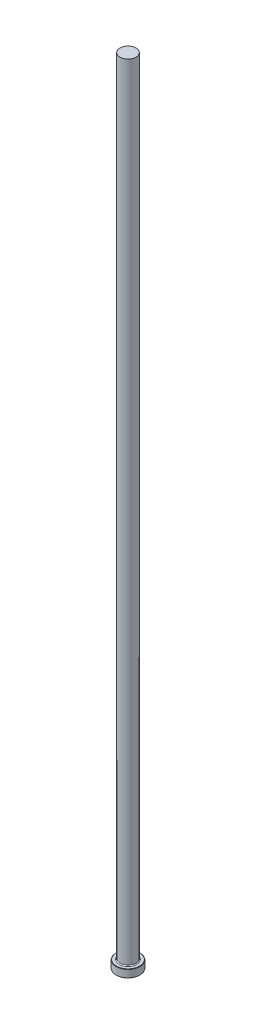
from build123d import *

# Parameters (mm, degrees)
CHAMFER1_SIZE = 0.254
FILLET1_R     = 0.762


with BuildPart() as part:
    # Sketch1 → Revolve1 (revolve)
    with BuildSketch(Plane.XY, mode=Mode.PRIVATE) as revolve1_sk:
        Polygon((0, 0), (-9.525, 0), (-9.525, 6.35), (-6.4135, 6.35), (-6.4135, 635), (0, 635), align=None)
    revolve(revolve1_sk.sketch.rotate(Axis((0, 259.958771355, 0), (0, -1, 0)), 270), axis=Axis((0, 259.958771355, 0), (0, -1, 0)))

    # Chamfer1
    chamfer1_edges = [part.edges().sort_by_distance(p)[0] for p in [
        (0, 6.35, -9.525),
        (0, 0, -9.525),
    ]]
    chamfer(chamfer1_edges, length=CHAMFER1_SIZE)

    # Fillet1
    fillet1_edges = [part.edges().sort_by_distance(p)[0] for p in [
        (0, 6.35, -6.4135),
    ]]
    fillet(fillet1_edges, radius=FILLET1_R)


solid = part.part
